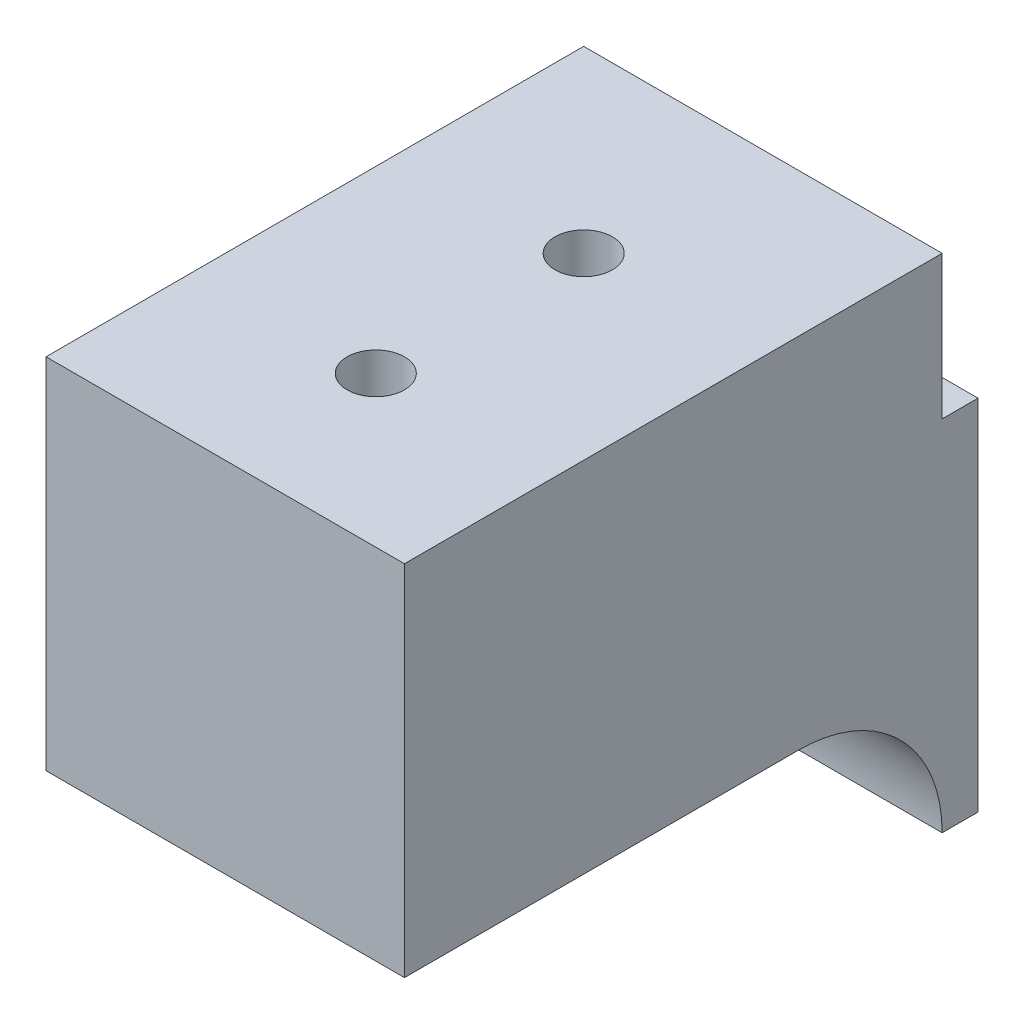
ISO-10303-21;
HEADER;
FILE_DESCRIPTION(('STEP AP214'),'2;1');
FILE_NAME('part.step','',(''),(''),'','','');
FILE_SCHEMA(('AUTOMOTIVE_DESIGN { 1 0 10303 214 1 1 1 1 }'));
ENDSEC;
DATA;
#1=APPLICATION_CONTEXT('core data for automotive mechanical design processes');
#2=APPLICATION_PROTOCOL_DEFINITION('international standard','automotive_design',2000,#1);
#3=PRODUCT_CONTEXT('',#1,'mechanical');
#4=PRODUCT('Part','Part','',(#3));
#5=PRODUCT_RELATED_PRODUCT_CATEGORY('part','',(#4));
#6=PRODUCT_DEFINITION_FORMATION('','',#4);
#7=PRODUCT_DEFINITION_CONTEXT('part definition',#1,'design');
#8=PRODUCT_DEFINITION('design','',#6,#7);
#9=PRODUCT_DEFINITION_SHAPE('','',#8);
#10=(LENGTH_UNIT() NAMED_UNIT(*) SI_UNIT(.MILLI.,.METRE.));
#11=(NAMED_UNIT(*) PLANE_ANGLE_UNIT() SI_UNIT($,.RADIAN.));
#12=(NAMED_UNIT(*) SI_UNIT($,.STERADIAN.) SOLID_ANGLE_UNIT());
#13=UNCERTAINTY_MEASURE_WITH_UNIT(LENGTH_MEASURE(1.E-05),#10,'distance_accuracy_value','');
#14=(GEOMETRIC_REPRESENTATION_CONTEXT(3) GLOBAL_UNCERTAINTY_ASSIGNED_CONTEXT((#13)) GLOBAL_UNIT_ASSIGNED_CONTEXT((#10,
#11,#12)) REPRESENTATION_CONTEXT('',''));
#15=CARTESIAN_POINT('',(0.,0.,0.));
#16=DIRECTION('',(0.,0.,1.));
#17=DIRECTION('',(1.,0.,0.));
#18=AXIS2_PLACEMENT_3D('',#15,#16,#17);
#19=CARTESIAN_POINT('',(50.,50.,0.));
#20=DIRECTION('',(1.,0.,0.));
#21=DIRECTION('',(0.,0.,-1.));
#22=AXIS2_PLACEMENT_3D('',#19,#20,#21);
#23=PLANE('',#22);
#24=DIRECTION('',(0.,1.,0.));
#25=VECTOR('',#24,1.);
#26=CARTESIAN_POINT('',(50.,50.,-75.));
#27=LINE('',#26,#25);
#28=CARTESIAN_POINT('',(50.,30.,-75.));
#29=VERTEX_POINT('',#28);
#30=CARTESIAN_POINT('',(50.,50.,-75.));
#31=VERTEX_POINT('',#30);
#32=EDGE_CURVE('E198',#29,#31,#27,.T.);
#33=ORIENTED_EDGE('',*,*,#32,.T.);
#34=DIRECTION('',(0.,0.,1.));
#35=VECTOR('',#34,1.);
#36=CARTESIAN_POINT('',(50.,50.,0.));
#37=LINE('',#36,#35);
#38=CARTESIAN_POINT('',(50.,50.,0.));
#39=VERTEX_POINT('',#38);
#40=EDGE_CURVE('E174',#31,#39,#37,.T.);
#41=ORIENTED_EDGE('',*,*,#40,.T.);
#42=DIRECTION('',(0.,-1.,0.));
#43=VECTOR('',#42,1.);
#44=CARTESIAN_POINT('',(50.,50.,0.));
#45=LINE('',#44,#43);
#46=CARTESIAN_POINT('',(50.,0.,0.));
#47=VERTEX_POINT('',#46);
#48=EDGE_CURVE('E151',#39,#47,#45,.T.);
#49=ORIENTED_EDGE('',*,*,#48,.T.);
#50=DIRECTION('',(0.,0.,1.));
#51=VECTOR('',#50,1.);
#52=CARTESIAN_POINT('',(50.,0.,0.));
#53=LINE('',#52,#51);
#54=CARTESIAN_POINT('',(50.,0.,-55.));
#55=VERTEX_POINT('',#54);
#56=EDGE_CURVE('E164',#55,#47,#53,.T.);
#57=ORIENTED_EDGE('',*,*,#56,.F.);
#58=CARTESIAN_POINT('',(50.,-20.,-55.));
#59=DIRECTION('',(1.,0.,0.));
#60=DIRECTION('',(0.,0.,-1.));
#61=AXIS2_PLACEMENT_3D('',#58,#59,#60);
#62=CIRCLE('',#61,20.);
#63=CARTESIAN_POINT('',(50.,-20.,-75.));
#64=VERTEX_POINT('',#63);
#65=EDGE_CURVE('E63',#55,#64,#62,.F.);
#66=ORIENTED_EDGE('',*,*,#65,.T.);
#67=DIRECTION('',(0.,0.,-1.));
#68=VECTOR('',#67,1.);
#69=CARTESIAN_POINT('',(50.,-20.,-80.));
#70=LINE('',#69,#68);
#71=CARTESIAN_POINT('',(50.,-20.,-80.));
#72=VERTEX_POINT('',#71);
#73=EDGE_CURVE('E120',#64,#72,#70,.T.);
#74=ORIENTED_EDGE('',*,*,#73,.T.);
#75=DIRECTION('',(0.,-1.,0.));
#76=VECTOR('',#75,1.);
#77=CARTESIAN_POINT('',(50.,50.,-80.));
#78=LINE('',#77,#76);
#79=CARTESIAN_POINT('',(50.,30.,-80.));
#80=VERTEX_POINT('',#79);
#81=EDGE_CURVE('E142',#80,#72,#78,.T.);
#82=ORIENTED_EDGE('',*,*,#81,.F.);
#83=DIRECTION('',(0.,0.,1.));
#84=VECTOR('',#83,1.);
#85=CARTESIAN_POINT('',(50.,30.,-75.));
#86=LINE('',#85,#84);
#87=EDGE_CURVE('E189',#80,#29,#86,.T.);
#88=ORIENTED_EDGE('',*,*,#87,.T.);
#89=EDGE_LOOP('',(#33,#41,#49,#57,#66,#74,#82,#88));
#90=FACE_BOUND('',#89,.T.);
#91=ADVANCED_FACE('F47',(#90),#23,.T.);
#92=CARTESIAN_POINT('',(0.,50.,-80.));
#93=DIRECTION('',(0.,0.,-1.));
#94=DIRECTION('',(-1.,0.,0.));
#95=AXIS2_PLACEMENT_3D('',#92,#93,#94);
#96=PLANE('',#95);
#97=DIRECTION('',(-1.,0.,0.));
#98=VECTOR('',#97,1.);
#99=CARTESIAN_POINT('',(50.,30.,-80.));
#100=LINE('',#99,#98);
#101=CARTESIAN_POINT('',(0.,30.,-80.));
#102=VERTEX_POINT('',#101);
#103=EDGE_CURVE('E188',#80,#102,#100,.T.);
#104=ORIENTED_EDGE('',*,*,#103,.F.);
#105=ORIENTED_EDGE('',*,*,#81,.T.);
#106=DIRECTION('',(1.,0.,0.));
#107=VECTOR('',#106,1.);
#108=CARTESIAN_POINT('',(0.,-20.,-80.));
#109=LINE('',#108,#107);
#110=CARTESIAN_POINT('',(0.,-20.,-80.));
#111=VERTEX_POINT('',#110);
#112=EDGE_CURVE('E122',#111,#72,#109,.T.);
#113=ORIENTED_EDGE('',*,*,#112,.F.);
#114=DIRECTION('',(0.,-1.,0.));
#115=VECTOR('',#114,1.);
#116=CARTESIAN_POINT('',(0.,50.,-80.));
#117=LINE('',#116,#115);
#118=EDGE_CURVE('E128',#102,#111,#117,.T.);
#119=ORIENTED_EDGE('',*,*,#118,.F.);
#120=EDGE_LOOP('',(#104,#105,#113,#119));
#121=FACE_BOUND('',#120,.T.);
#122=ADVANCED_FACE('F234',(#121),#96,.T.);
#123=CARTESIAN_POINT('',(0.,50.,0.));
#124=DIRECTION('',(1.,0.,0.));
#125=DIRECTION('',(0.,0.,-1.));
#126=AXIS2_PLACEMENT_3D('',#123,#124,#125);
#127=PLANE('',#126);
#128=DIRECTION('',(0.,0.,1.));
#129=VECTOR('',#128,1.);
#130=CARTESIAN_POINT('',(0.,50.,0.));
#131=LINE('',#130,#129);
#132=CARTESIAN_POINT('',(0.,50.,-75.));
#133=VERTEX_POINT('',#132);
#134=CARTESIAN_POINT('',(0.,50.,0.));
#135=VERTEX_POINT('',#134);
#136=EDGE_CURVE('E171',#133,#135,#131,.T.);
#137=ORIENTED_EDGE('',*,*,#136,.F.);
#138=DIRECTION('',(0.,1.,0.));
#139=VECTOR('',#138,1.);
#140=CARTESIAN_POINT('',(0.,50.,-75.));
#141=LINE('',#140,#139);
#142=CARTESIAN_POINT('',(0.,30.,-75.));
#143=VERTEX_POINT('',#142);
#144=EDGE_CURVE('E199',#143,#133,#141,.T.);
#145=ORIENTED_EDGE('',*,*,#144,.F.);
#146=DIRECTION('',(0.,0.,1.));
#147=VECTOR('',#146,1.);
#148=CARTESIAN_POINT('',(0.,30.,-75.));
#149=LINE('',#148,#147);
#150=EDGE_CURVE('E194',#102,#143,#149,.T.);
#151=ORIENTED_EDGE('',*,*,#150,.F.);
#152=ORIENTED_EDGE('',*,*,#118,.T.);
#153=DIRECTION('',(0.,0.,-1.));
#154=VECTOR('',#153,1.);
#155=CARTESIAN_POINT('',(0.,-20.,-80.));
#156=LINE('',#155,#154);
#157=CARTESIAN_POINT('',(0.,-20.,-75.));
#158=VERTEX_POINT('',#157);
#159=EDGE_CURVE('E118',#158,#111,#156,.T.);
#160=ORIENTED_EDGE('',*,*,#159,.F.);
#161=CARTESIAN_POINT('',(0.,-20.,-55.));
#162=DIRECTION('',(1.,0.,0.));
#163=DIRECTION('',(0.,0.,-1.));
#164=AXIS2_PLACEMENT_3D('',#161,#162,#163);
#165=CIRCLE('',#164,20.);
#166=CARTESIAN_POINT('',(0.,0.,-55.));
#167=VERTEX_POINT('',#166);
#168=EDGE_CURVE('E71',#158,#167,#165,.T.);
#169=ORIENTED_EDGE('',*,*,#168,.T.);
#170=DIRECTION('',(0.,0.,1.));
#171=VECTOR('',#170,1.);
#172=CARTESIAN_POINT('',(0.,0.,0.));
#173=LINE('',#172,#171);
#174=CARTESIAN_POINT('',(0.,0.,0.));
#175=VERTEX_POINT('',#174);
#176=EDGE_CURVE('E161',#167,#175,#173,.T.);
#177=ORIENTED_EDGE('',*,*,#176,.T.);
#178=DIRECTION('',(0.,-1.,0.));
#179=VECTOR('',#178,1.);
#180=CARTESIAN_POINT('',(0.,50.,0.));
#181=LINE('',#180,#179);
#182=EDGE_CURVE('E147',#135,#175,#181,.T.);
#183=ORIENTED_EDGE('',*,*,#182,.F.);
#184=EDGE_LOOP('',(#137,#145,#151,#152,#160,#169,#177,#183));
#185=FACE_BOUND('',#184,.T.);
#186=ADVANCED_FACE('F125',(#185),#127,.F.);
#187=CARTESIAN_POINT('',(25.,50.,-50.));
#188=DIRECTION('',(0.,-1.,0.));
#189=DIRECTION('',(0.,0.,-1.));
#190=AXIS2_PLACEMENT_3D('',#187,#188,#189);
#191=CYLINDRICAL_SURFACE('',#190,3.99999999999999);
#192=CARTESIAN_POINT('',(25.,10.,-50.));
#193=DIRECTION('',(0.,1.,0.));
#194=DIRECTION('',(0.,0.,1.));
#195=AXIS2_PLACEMENT_3D('',#192,#193,#194);
#196=CIRCLE('',#195,3.99999999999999);
#197=CARTESIAN_POINT('',(25.,10.,-46.));
#198=VERTEX_POINT('',#197);
#199=EDGE_CURVE('E12',#198,#198,#196,.T.);
#200=ORIENTED_EDGE('',*,*,#199,.F.);
#201=EDGE_LOOP('',(#200));
#202=FACE_BOUND('',#201,.T.);
#203=CARTESIAN_POINT('',(25.,50.,-50.));
#204=DIRECTION('',(0.,1.,0.));
#205=DIRECTION('',(0.,0.,1.));
#206=AXIS2_PLACEMENT_3D('',#203,#204,#205);
#207=CIRCLE('',#206,3.99999999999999);
#208=CARTESIAN_POINT('',(25.,50.,-46.));
#209=VERTEX_POINT('',#208);
#210=EDGE_CURVE('E177',#209,#209,#207,.T.);
#211=ORIENTED_EDGE('',*,*,#210,.T.);
#212=EDGE_LOOP('',(#211));
#213=FACE_BOUND('',#212,.T.);
#214=ADVANCED_FACE('F241',(#202,#213),#191,.F.);
#215=CARTESIAN_POINT('',(25.,50.,-21.));
#216=DIRECTION('',(0.,-1.,0.));
#217=DIRECTION('',(0.,0.,-1.));
#218=AXIS2_PLACEMENT_3D('',#215,#216,#217);
#219=CYLINDRICAL_SURFACE('',#218,4.);
#220=CARTESIAN_POINT('',(25.,10.,-21.));
#221=DIRECTION('',(0.,1.,0.));
#222=DIRECTION('',(0.,0.,1.));
#223=AXIS2_PLACEMENT_3D('',#220,#221,#222);
#224=CIRCLE('',#223,4.);
#225=CARTESIAN_POINT('',(25.,10.,-17.));
#226=VERTEX_POINT('',#225);
#227=EDGE_CURVE('E56',#226,#226,#224,.T.);
#228=ORIENTED_EDGE('',*,*,#227,.F.);
#229=EDGE_LOOP('',(#228));
#230=FACE_BOUND('',#229,.T.);
#231=CARTESIAN_POINT('',(25.,50.,-21.));
#232=DIRECTION('',(0.,1.,0.));
#233=DIRECTION('',(0.,0.,1.));
#234=AXIS2_PLACEMENT_3D('',#231,#232,#233);
#235=CIRCLE('',#234,4.);
#236=CARTESIAN_POINT('',(25.,50.,-17.));
#237=VERTEX_POINT('',#236);
#238=EDGE_CURVE('E160',#237,#237,#235,.T.);
#239=ORIENTED_EDGE('',*,*,#238,.T.);
#240=EDGE_LOOP('',(#239));
#241=FACE_BOUND('',#240,.T.);
#242=ADVANCED_FACE('F247',(#230,#241),#219,.F.);
#243=CARTESIAN_POINT('',(0.,50.,0.));
#244=DIRECTION('',(0.,0.,-1.));
#245=DIRECTION('',(-1.,0.,0.));
#246=AXIS2_PLACEMENT_3D('',#243,#244,#245);
#247=PLANE('',#246);
#248=ORIENTED_EDGE('',*,*,#182,.T.);
#249=DIRECTION('',(1.,0.,0.));
#250=VECTOR('',#249,1.);
#251=CARTESIAN_POINT('',(0.,0.,0.));
#252=LINE('',#251,#250);
#253=EDGE_CURVE('E156',#175,#47,#252,.T.);
#254=ORIENTED_EDGE('',*,*,#253,.T.);
#255=ORIENTED_EDGE('',*,*,#48,.F.);
#256=DIRECTION('',(1.,0.,0.));
#257=VECTOR('',#256,1.);
#258=CARTESIAN_POINT('',(0.,50.,0.));
#259=LINE('',#258,#257);
#260=EDGE_CURVE('E155',#135,#39,#259,.T.);
#261=ORIENTED_EDGE('',*,*,#260,.F.);
#262=EDGE_LOOP('',(#248,#254,#255,#261));
#263=FACE_BOUND('',#262,.T.);
#264=ADVANCED_FACE('F221',(#263),#247,.F.);
#265=CARTESIAN_POINT('',(0.,50.,0.));
#266=DIRECTION('',(0.,1.,0.));
#267=DIRECTION('',(0.,0.,1.));
#268=AXIS2_PLACEMENT_3D('',#265,#266,#267);
#269=PLANE('',#268);
#270=DIRECTION('',(-1.,0.,0.));
#271=VECTOR('',#270,1.);
#272=CARTESIAN_POINT('',(50.,50.,-75.));
#273=LINE('',#272,#271);
#274=EDGE_CURVE('E184',#31,#133,#273,.T.);
#275=ORIENTED_EDGE('',*,*,#274,.T.);
#276=ORIENTED_EDGE('',*,*,#136,.T.);
#277=ORIENTED_EDGE('',*,*,#260,.T.);
#278=ORIENTED_EDGE('',*,*,#40,.F.);
#279=EDGE_LOOP('',(#275,#276,#277,#278));
#280=FACE_BOUND('',#279,.T.);
#281=ORIENTED_EDGE('',*,*,#238,.F.);
#282=EDGE_LOOP('',(#281));
#283=FACE_BOUND('',#282,.T.);
#284=ORIENTED_EDGE('',*,*,#210,.F.);
#285=EDGE_LOOP('',(#284));
#286=FACE_BOUND('',#285,.T.);
#287=ADVANCED_FACE('F224',(#280,#283,#286),#269,.T.);
#288=CARTESIAN_POINT('',(0.,0.,0.));
#289=DIRECTION('',(0.,1.,0.));
#290=DIRECTION('',(0.,0.,1.));
#291=AXIS2_PLACEMENT_3D('',#288,#289,#290);
#292=PLANE('',#291);
#293=ORIENTED_EDGE('',*,*,#176,.F.);
#294=DIRECTION('',(1.,0.,0.));
#295=VECTOR('',#294,1.);
#296=CARTESIAN_POINT('',(0.,0.,-55.));
#297=LINE('',#296,#295);
#298=EDGE_CURVE('E132',#167,#55,#297,.T.);
#299=ORIENTED_EDGE('',*,*,#298,.T.);
#300=ORIENTED_EDGE('',*,*,#56,.T.);
#301=ORIENTED_EDGE('',*,*,#253,.F.);
#302=EDGE_LOOP('',(#293,#299,#300,#301));
#303=FACE_BOUND('',#302,.T.);
#304=ADVANCED_FACE('F217',(#303),#292,.F.);
#305=CARTESIAN_POINT('',(50.,50.,-75.));
#306=DIRECTION('',(0.,0.,1.));
#307=DIRECTION('',(1.,0.,0.));
#308=AXIS2_PLACEMENT_3D('',#305,#306,#307);
#309=PLANE('',#308);
#310=ORIENTED_EDGE('',*,*,#144,.T.);
#311=ORIENTED_EDGE('',*,*,#274,.F.);
#312=ORIENTED_EDGE('',*,*,#32,.F.);
#313=DIRECTION('',(-1.,0.,0.));
#314=VECTOR('',#313,1.);
#315=CARTESIAN_POINT('',(50.,30.,-75.));
#316=LINE('',#315,#314);
#317=EDGE_CURVE('E167',#29,#143,#316,.T.);
#318=ORIENTED_EDGE('',*,*,#317,.T.);
#319=EDGE_LOOP('',(#310,#311,#312,#318));
#320=FACE_BOUND('',#319,.T.);
#321=ADVANCED_FACE('F228',(#320),#309,.F.);
#322=CARTESIAN_POINT('',(50.,30.,-75.));
#323=DIRECTION('',(0.,-1.,0.));
#324=DIRECTION('',(0.,0.,-1.));
#325=AXIS2_PLACEMENT_3D('',#322,#323,#324);
#326=PLANE('',#325);
#327=ORIENTED_EDGE('',*,*,#150,.T.);
#328=ORIENTED_EDGE('',*,*,#317,.F.);
#329=ORIENTED_EDGE('',*,*,#87,.F.);
#330=ORIENTED_EDGE('',*,*,#103,.T.);
#331=EDGE_LOOP('',(#327,#328,#329,#330));
#332=FACE_BOUND('',#331,.T.);
#333=ADVANCED_FACE('F231',(#332),#326,.F.);
#334=CARTESIAN_POINT('',(0.,-20.,-80.));
#335=DIRECTION('',(0.,-1.,0.));
#336=DIRECTION('',(0.,0.,-1.));
#337=AXIS2_PLACEMENT_3D('',#334,#335,#336);
#338=PLANE('',#337);
#339=ORIENTED_EDGE('',*,*,#73,.F.);
#340=DIRECTION('',(1.,0.,0.));
#341=VECTOR('',#340,1.);
#342=CARTESIAN_POINT('',(0.,-20.,-75.));
#343=LINE('',#342,#341);
#344=EDGE_CURVE('E115',#158,#64,#343,.T.);
#345=ORIENTED_EDGE('',*,*,#344,.F.);
#346=ORIENTED_EDGE('',*,*,#159,.T.);
#347=ORIENTED_EDGE('',*,*,#112,.T.);
#348=EDGE_LOOP('',(#339,#345,#346,#347));
#349=FACE_BOUND('',#348,.T.);
#350=ADVANCED_FACE('F116',(#349),#338,.T.);
#351=CARTESIAN_POINT('',(0.,-20.,-55.));
#352=DIRECTION('',(1.,0.,0.));
#353=DIRECTION('',(0.,0.,-1.));
#354=AXIS2_PLACEMENT_3D('',#351,#352,#353);
#355=CYLINDRICAL_SURFACE('',#354,20.);
#356=ORIENTED_EDGE('',*,*,#168,.F.);
#357=ORIENTED_EDGE('',*,*,#344,.T.);
#358=ORIENTED_EDGE('',*,*,#65,.F.);
#359=ORIENTED_EDGE('',*,*,#298,.F.);
#360=EDGE_LOOP('',(#356,#357,#358,#359));
#361=FACE_BOUND('',#360,.T.);
#362=ADVANCED_FACE('F49',(#361),#355,.F.);
#363=CARTESIAN_POINT('',(0.,10.,0.));
#364=DIRECTION('',(0.,1.,0.));
#365=DIRECTION('',(0.,0.,1.));
#366=AXIS2_PLACEMENT_3D('',#363,#364,#365);
#367=PLANE('',#366);
#368=ORIENTED_EDGE('',*,*,#227,.T.);
#369=EDGE_LOOP('',(#368));
#370=FACE_BOUND('',#369,.T.);
#371=ADVANCED_FACE('F273',(#370),#367,.T.);
#372=CARTESIAN_POINT('',(0.,10.,0.));
#373=DIRECTION('',(0.,1.,0.));
#374=DIRECTION('',(0.,0.,1.));
#375=AXIS2_PLACEMENT_3D('',#372,#373,#374);
#376=PLANE('',#375);
#377=ORIENTED_EDGE('',*,*,#199,.T.);
#378=EDGE_LOOP('',(#377));
#379=FACE_BOUND('',#378,.T.);
#380=ADVANCED_FACE('F276',(#379),#376,.T.);
#381=CLOSED_SHELL('',(#91,#122,#186,#214,#242,#264,#287,#304,#321,#333,#350,#362,#371,#380));
#382=MANIFOLD_SOLID_BREP('B2',#381);
#383=ADVANCED_BREP_SHAPE_REPRESENTATION('',(#18,#382),#14);
#384=SHAPE_DEFINITION_REPRESENTATION(#9,#383);
ENDSEC;
END-ISO-10303-21;
